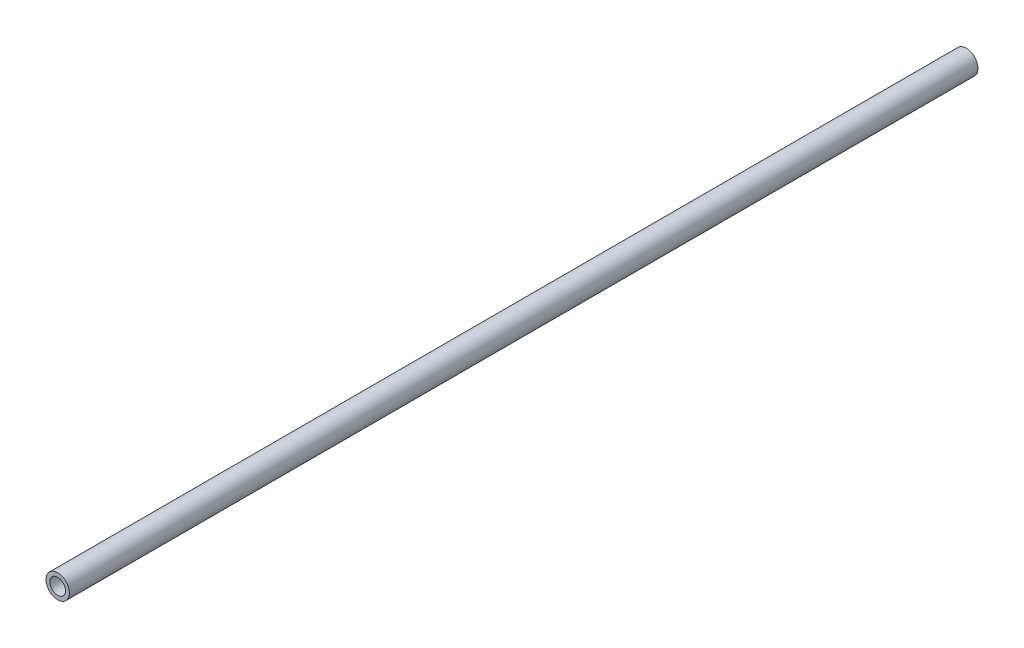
from build123d import *

# Parameters (mm, degrees)
ESQUISSE1_R        = 3
ESQUISSE1_R_2      = 2
BOSS_EXTRU_1_DEPTH = 116.4


with BuildPart() as part:
    # Esquisse1 → Boss.-Extru.1 (new, symmetric)
    with BuildSketch(Plane.XY):
        Circle(ESQUISSE1_R)
        Circle(ESQUISSE1_R_2, mode=Mode.SUBTRACT)
    extrude(amount=BOSS_EXTRU_1_DEPTH, both=True)


solid = part.part
